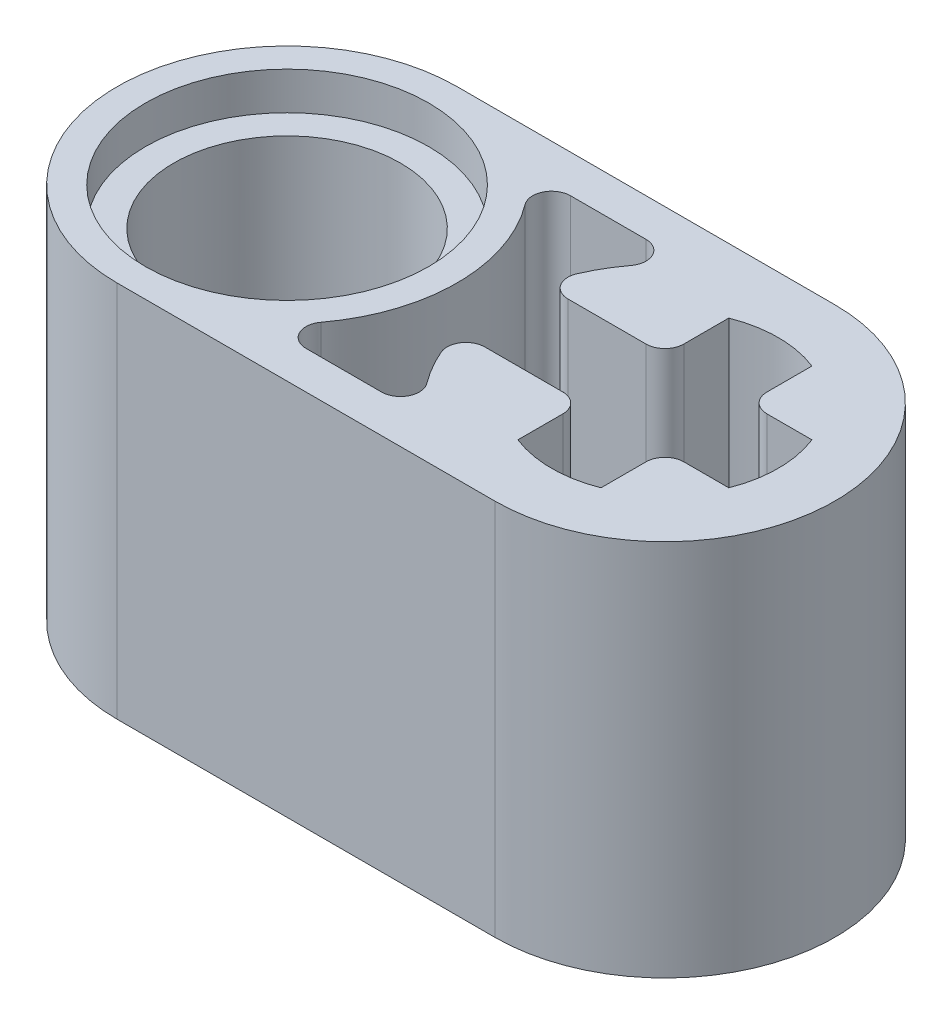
from build123d import *

# Parameters (mm, degrees)
SKETCH1_R           = 2.4
BOSS_EXTRUDE1_DEPTH = 8
SKETCH2_R           = 3
CUT_EXTRUDE1_DEPTH  = 0.8
CUT_EXTRUDE2_START  = -0.8
SKETCH3_R           = 3
CUT_EXTRUDE2_DEPTH  = 0.8


with BuildPart() as part:
    # Sketch1 → Boss-Extrude1 (new body)
    with BuildSketch(Plane(origin=(0, 0, 0), x_dir=(1, 0, 0), z_dir=(0, 1, 0))):
        with BuildLine():
            Line((-4, 3.6), (4, 3.6))
            ThreePointArc((4, 3.6), (7.6, 0), (4, -3.6))
            Line((4, -3.6), (-4, -3.6))
            ThreePointArc((-4, -3.6), (-7.6, 0), (-4, 3.6))
        make_face()
        with Locations(Location((-4, 0, 0), (0, 0, 270))):
            Circle(SKETCH1_R, mode=Mode.SUBTRACT)
        with BuildLine():
            Line((3.12, 2.232845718), (3.12, 1.28))
            ThreePointArc((3.12, 1.28), (3.002842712, 0.997157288), (2.72, 0.88))
            Line((2.72, 0.88), (1.767154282, 0.88))
            Line((1.767154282, 0.88), (1.067151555, 0.88))
            ThreePointArc((1.067151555, 0.88), (0.732487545, 1.060910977), (0.7005455, 1.44))
            ThreePointArc((0.7005455, 1.44), (0.889370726, 1.812177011), (1.12, 2.16))
            ThreePointArc((1.12, 2.16), (1.157770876, 2.578885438), (0.8, 2.8))
            Line((0.8, 2.8), (-0.8, 2.8))
            ThreePointArc((-0.8, 2.8), (-1.157770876, 2.578885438), (-1.12, 2.16))
            ThreePointArc((-1.12, 2.16), (-0.4, 0), (-1.12, -2.16))
            ThreePointArc((-1.12, -2.16), (-1.157770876, -2.578885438), (-0.8, -2.8))
            Line((-0.8, -2.8), (0.8, -2.8))
            ThreePointArc((0.8, -2.8), (1.157770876, -2.578885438), (1.12, -2.16))
            ThreePointArc((1.12, -2.16), (0.889370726, -1.812177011), (0.7005455, -1.44))
            ThreePointArc((0.7005455, -1.44), (0.732487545, -1.060910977), (1.067151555, -0.88))
            Line((1.067151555, -0.88), (1.767154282, -0.88))
            Line((1.767154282, -0.88), (2.72, -0.88))
            ThreePointArc((2.72, -0.88), (3.002842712, -0.997157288), (3.12, -1.28))
            Line((3.12, -1.28), (3.12, -2.232845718))
            ThreePointArc((3.12, -2.232845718), (4, -2.4), (4.88, -2.232845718))
            Line((4.88, -2.232845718), (4.88, -1.28))
            ThreePointArc((4.88, -1.28), (4.997157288, -0.997157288), (5.28, -0.88))
            Line((5.28, -0.88), (6.232845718, -0.88))
            ThreePointArc((6.232845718, -0.88), (6.4, 0), (6.232845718, 0.88))
            Line((6.232845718, 0.88), (5.28, 0.88))
            ThreePointArc((5.28, 0.88), (4.997157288, 0.997157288), (4.88, 1.28))
            Line((4.88, 1.28), (4.88, 2.232845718))
            ThreePointArc((4.88, 2.232845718), (4, 2.4), (3.12, 2.232845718))
        make_face(mode=Mode.SUBTRACT)
    extrude(amount=BOSS_EXTRUDE1_DEPTH)

    # Sketch2 → Cut-Extrude1 (cut)
    with BuildSketch(Plane(origin=(0, 8, 0), x_dir=(1, 0, 0), z_dir=(0, 1, 0))):
        with Locations(Location((-4, 0, 0), (0, 0, 270))):
            Circle(SKETCH2_R)
    extrude(amount=-CUT_EXTRUDE1_DEPTH, mode=Mode.SUBTRACT)

    # Sketch3 → Cut-Extrude2 (cut)
    with BuildSketch(Plane.XZ.offset(CUT_EXTRUDE2_START)):
        with Locations(Location((-4, 0, 0), (0, 0, 90))):
            Circle(SKETCH3_R)
    extrude(amount=CUT_EXTRUDE2_DEPTH, mode=Mode.SUBTRACT)


solid = part.part
